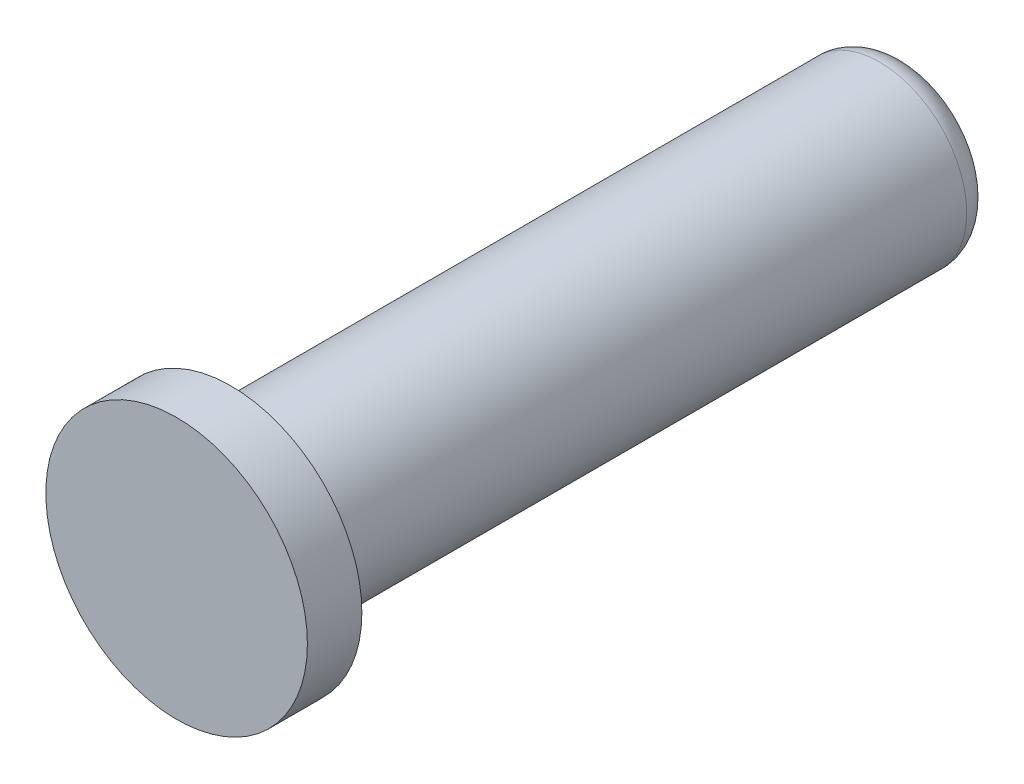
from build123d import *


with BuildPart() as part:
    # Sketch1 → Revolve1 (revolve)
    with BuildSketch(Plane(origin=(0, 0, 0), x_dir=(0, 0, -1), z_dir=(1, 0, 0)), mode=Mode.PRIVATE) as revolve1_sk:
        with BuildLine():
            Line((0, 0), (0, 12))
            Line((0, 12), (5, 12))
            Line((5, 12), (5, 8))
            Line((5, 8), (64.5, 8))
            ThreePointArc((64.5, 8), (66.267766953, 7.267766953), (67, 5.5))
            Line((67, 5.5), (67, 0))
            Line((67, 0), (0, 0))
        make_face()
    revolve(revolve1_sk.sketch.rotate(Axis((0, 0, 0), (0, 0, -1)), 90), axis=Axis((0, 0, 0), (0, 0, -1)))

    # Sketch3 → Cut-Revolve1 (revolve, cut)
    with BuildSketch(Plane(origin=(0, 0, 0), x_dir=(0, 0, -1), z_dir=(1, 0, 0))):
        Polygon((67, 3), (67, 0), (59.989934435, 0), (61, 2.5), (66.5, 2.5), align=None)
    revolve(axis=Axis((0, 0, -67), (0, 0, 1)), mode=Mode.SUBTRACT)


solid = part.part
